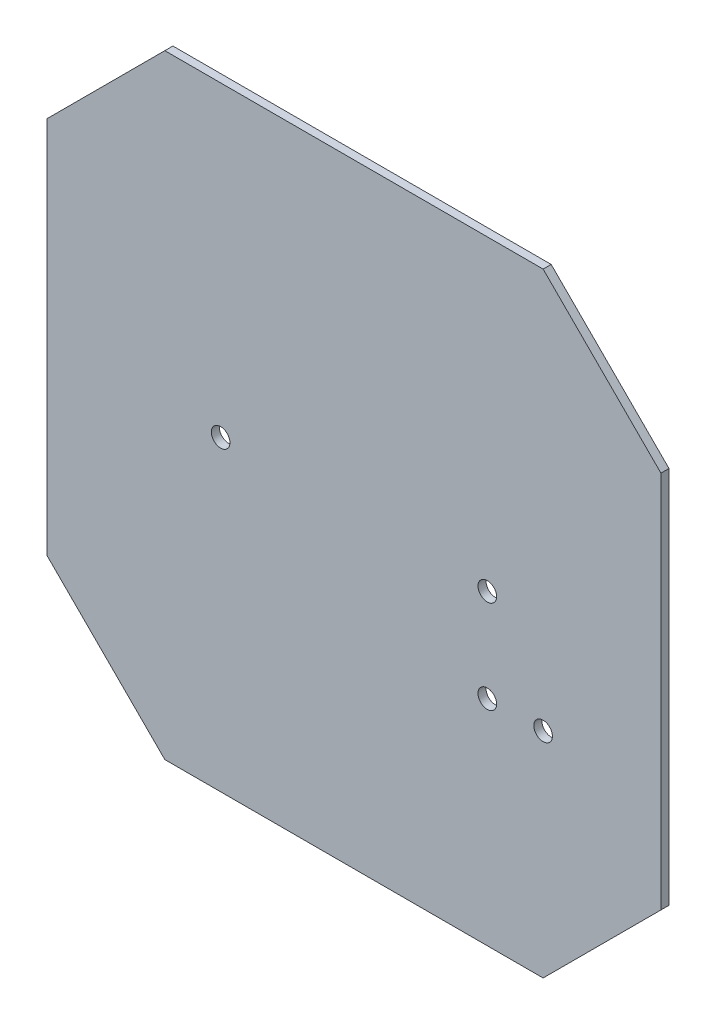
from build123d import *

# Parameters (mm, degrees)
SKETCH1_R           = 1.5
BOSS_EXTRUDE1_DEPTH = 1.3


with BuildPart() as part:
    # Sketch1 → Boss-Extrude1 (new body)
    with BuildSketch(Plane.XY):
        Polygon((-29.648967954, 62.034735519), (-29.648967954, 1.034735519), (-10.648967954, -17.965264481), (50.351032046, -17.965264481), (69.351032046, 1.034735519), (69.351032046, 62.034735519), (50.351032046, 81.034735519), (-10.648967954, 81.034735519), align=None)
        with Locations((-1.648967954, 31.534735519)):
            Circle(SKETCH1_R, mode=Mode.SUBTRACT)
        with Locations((41.351032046, 31.534735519)):
            Circle(SKETCH1_R, mode=Mode.SUBTRACT)
        with Locations((41.351032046, 16.534735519)):
            Circle(SKETCH1_R, mode=Mode.SUBTRACT)
        with Locations((50.351032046, 16.534735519)):
            Circle(SKETCH1_R, mode=Mode.SUBTRACT)
    extrude(amount=BOSS_EXTRUDE1_DEPTH)


solid = part.part
